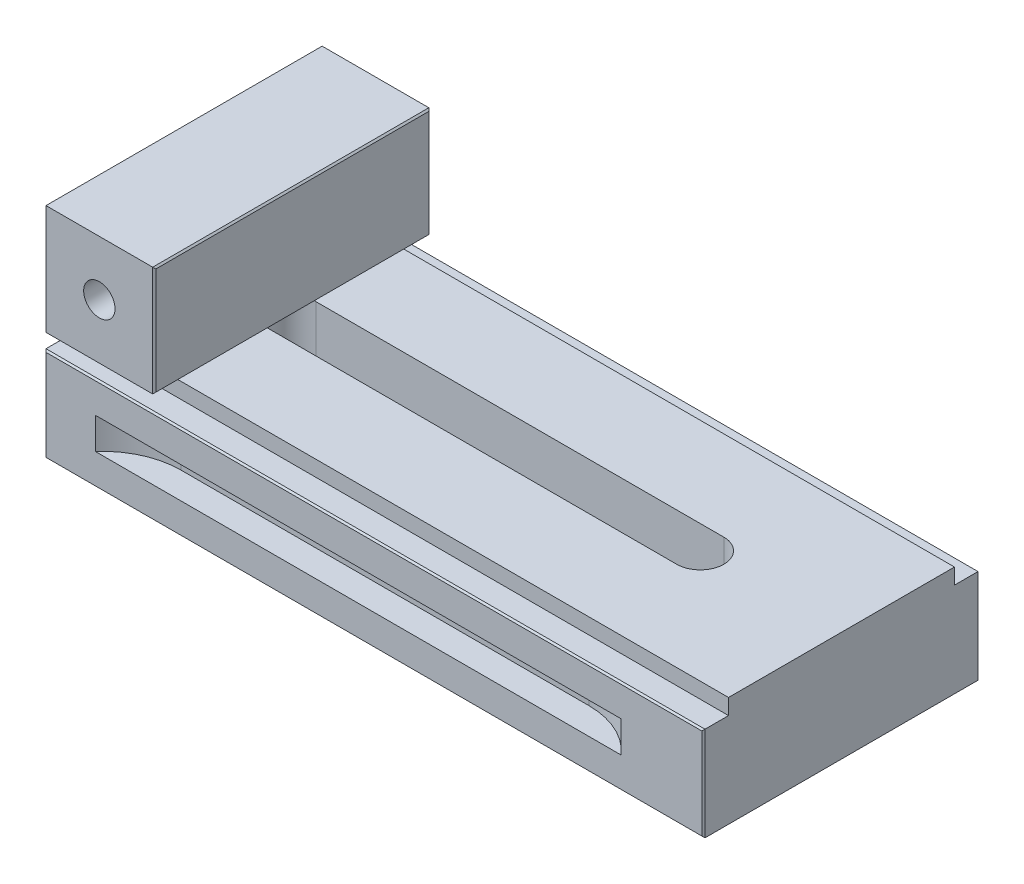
ISO-10303-21;
HEADER;
FILE_DESCRIPTION(('STEP AP214'),'2;1');
FILE_NAME('part.step','',(''),(''),'','','');
FILE_SCHEMA(('AUTOMOTIVE_DESIGN { 1 0 10303 214 1 1 1 1 }'));
ENDSEC;
DATA;
#1=APPLICATION_CONTEXT('core data for automotive mechanical design processes');
#2=APPLICATION_PROTOCOL_DEFINITION('international standard','automotive_design',2000,#1);
#3=PRODUCT_CONTEXT('',#1,'mechanical');
#4=PRODUCT('Part','Part','',(#3));
#5=PRODUCT_RELATED_PRODUCT_CATEGORY('part','',(#4));
#6=PRODUCT_DEFINITION_FORMATION('','',#4);
#7=PRODUCT_DEFINITION_CONTEXT('part definition',#1,'design');
#8=PRODUCT_DEFINITION('design','',#6,#7);
#9=PRODUCT_DEFINITION_SHAPE('','',#8);
#10=(LENGTH_UNIT() NAMED_UNIT(*) SI_UNIT(.MILLI.,.METRE.));
#11=(NAMED_UNIT(*) PLANE_ANGLE_UNIT() SI_UNIT($,.RADIAN.));
#12=(NAMED_UNIT(*) SI_UNIT($,.STERADIAN.) SOLID_ANGLE_UNIT());
#13=UNCERTAINTY_MEASURE_WITH_UNIT(LENGTH_MEASURE(1.E-05),#10,'distance_accuracy_value','');
#14=(GEOMETRIC_REPRESENTATION_CONTEXT(3) GLOBAL_UNCERTAINTY_ASSIGNED_CONTEXT((#13)) GLOBAL_UNIT_ASSIGNED_CONTEXT((#10,
#11,#12)) REPRESENTATION_CONTEXT('',''));
#15=CARTESIAN_POINT('',(0.,0.,0.));
#16=DIRECTION('',(0.,0.,1.));
#17=DIRECTION('',(1.,0.,0.));
#18=AXIS2_PLACEMENT_3D('',#15,#16,#17);
#19=CARTESIAN_POINT('',(0.,-35.,44.));
#20=DIRECTION('',(0.,1.,0.));
#21=DIRECTION('',(0.,0.,1.));
#22=AXIS2_PLACEMENT_3D('',#19,#20,#21);
#23=PLANE('',#22);
#24=DIRECTION('',(-1.,0.,0.));
#25=VECTOR('',#24,1.);
#26=CARTESIAN_POINT('',(175.,-35.,36.));
#27=LINE('',#26,#25);
#28=CARTESIAN_POINT('',(-0.5,-35.,36.));
#29=VERTEX_POINT('',#28);
#30=CARTESIAN_POINT('',(-34.5,-35.,36.));
#31=VERTEX_POINT('',#30);
#32=EDGE_CURVE('E403',#29,#31,#27,.T.);
#33=ORIENTED_EDGE('',*,*,#32,.F.);
#34=DIRECTION('',(0.,0.,1.));
#35=VECTOR('',#34,1.);
#36=CARTESIAN_POINT('',(-0.499999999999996,-35.,44.));
#37=LINE('',#36,#35);
#38=CARTESIAN_POINT('',(-0.499999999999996,-35.,44.));
#39=VERTEX_POINT('',#38);
#40=EDGE_CURVE('E460',#29,#39,#37,.T.);
#41=ORIENTED_EDGE('',*,*,#40,.T.);
#42=DIRECTION('',(1.,0.,0.));
#43=VECTOR('',#42,1.);
#44=CARTESIAN_POINT('',(0.,-35.,44.));
#45=LINE('',#44,#43);
#46=CARTESIAN_POINT('',(-34.5,-35.,44.));
#47=VERTEX_POINT('',#46);
#48=EDGE_CURVE('E442',#47,#39,#45,.T.);
#49=ORIENTED_EDGE('',*,*,#48,.F.);
#50=DIRECTION('',(0.,0.,-1.));
#51=VECTOR('',#50,1.);
#52=CARTESIAN_POINT('',(-34.5,-35.,44.));
#53=LINE('',#52,#51);
#54=EDGE_CURVE('E467',#47,#31,#53,.T.);
#55=ORIENTED_EDGE('',*,*,#54,.T.);
#56=EDGE_LOOP('',(#33,#41,#49,#55));
#57=FACE_BOUND('',#56,.T.);
#58=ADVANCED_FACE('F28',(#57),#23,.F.);
#59=CARTESIAN_POINT('',(0.,0.,44.));
#60=DIRECTION('',(-1.,0.,0.));
#61=DIRECTION('',(0.,-1.,0.));
#62=AXIS2_PLACEMENT_3D('',#59,#60,#61);
#63=PLANE('',#62);
#64=DIRECTION('',(0.,0.,-1.));
#65=VECTOR('',#64,1.);
#66=CARTESIAN_POINT('',(0.,-34.5,44.));
#67=LINE('',#66,#65);
#68=CARTESIAN_POINT('',(0.,-34.5,43.5));
#69=VERTEX_POINT('',#68);
#70=CARTESIAN_POINT('',(0.,-34.5,-43.5));
#71=VERTEX_POINT('',#70);
#72=EDGE_CURVE('E483',#69,#71,#67,.T.);
#73=ORIENTED_EDGE('',*,*,#72,.T.);
#74=DIRECTION('',(0.,1.,0.));
#75=VECTOR('',#74,1.);
#76=CARTESIAN_POINT('',(0.,0.,-43.5));
#77=LINE('',#76,#75);
#78=CARTESIAN_POINT('',(0.,-0.500000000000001,-43.5));
#79=VERTEX_POINT('',#78);
#80=EDGE_CURVE('E485',#71,#79,#77,.T.);
#81=ORIENTED_EDGE('',*,*,#80,.T.);
#82=DIRECTION('',(0.,0.,1.));
#83=VECTOR('',#82,1.);
#84=CARTESIAN_POINT('',(0.,-0.500000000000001,44.));
#85=LINE('',#84,#83);
#86=CARTESIAN_POINT('',(0.,-0.500000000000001,43.5));
#87=VERTEX_POINT('',#86);
#88=EDGE_CURVE('E479',#79,#87,#85,.T.);
#89=ORIENTED_EDGE('',*,*,#88,.T.);
#90=DIRECTION('',(0.,-1.,0.));
#91=VECTOR('',#90,1.);
#92=CARTESIAN_POINT('',(0.,0.,43.5));
#93=LINE('',#92,#91);
#94=EDGE_CURVE('E481',#87,#69,#93,.T.);
#95=ORIENTED_EDGE('',*,*,#94,.T.);
#96=EDGE_LOOP('',(#73,#81,#89,#95));
#97=FACE_BOUND('',#96,.T.);
#98=ADVANCED_FACE('F30',(#97),#63,.F.);
#99=CARTESIAN_POINT('',(0.,0.,44.));
#100=DIRECTION('',(0.,-1.,0.));
#101=DIRECTION('',(1.,0.,0.));
#102=AXIS2_PLACEMENT_3D('',#99,#100,#101);
#103=PLANE('',#102);
#104=DIRECTION('',(-1.,0.,0.));
#105=VECTOR('',#104,1.);
#106=CARTESIAN_POINT('',(0.,0.,-44.));
#107=LINE('',#106,#105);
#108=CARTESIAN_POINT('',(-0.5,0.,-44.));
#109=VERTEX_POINT('',#108);
#110=CARTESIAN_POINT('',(-34.5,0.,-44.));
#111=VERTEX_POINT('',#110);
#112=EDGE_CURVE('E433',#109,#111,#107,.T.);
#113=ORIENTED_EDGE('',*,*,#112,.T.);
#114=DIRECTION('',(0.,0.,1.));
#115=VECTOR('',#114,1.);
#116=CARTESIAN_POINT('',(-34.5,0.,44.));
#117=LINE('',#116,#115);
#118=CARTESIAN_POINT('',(-34.5,0.,44.));
#119=VERTEX_POINT('',#118);
#120=EDGE_CURVE('E477',#111,#119,#117,.T.);
#121=ORIENTED_EDGE('',*,*,#120,.T.);
#122=DIRECTION('',(-1.,0.,0.));
#123=VECTOR('',#122,1.);
#124=CARTESIAN_POINT('',(0.,0.,44.));
#125=LINE('',#124,#123);
#126=CARTESIAN_POINT('',(-0.5,0.,44.));
#127=VERTEX_POINT('',#126);
#128=EDGE_CURVE('E439',#127,#119,#125,.T.);
#129=ORIENTED_EDGE('',*,*,#128,.F.);
#130=DIRECTION('',(0.,0.,-1.));
#131=VECTOR('',#130,1.);
#132=CARTESIAN_POINT('',(-0.5,0.,44.));
#133=LINE('',#132,#131);
#134=EDGE_CURVE('E475',#127,#109,#133,.T.);
#135=ORIENTED_EDGE('',*,*,#134,.T.);
#136=EDGE_LOOP('',(#113,#121,#129,#135));
#137=FACE_BOUND('',#136,.T.);
#138=ADVANCED_FACE('F563',(#137),#103,.F.);
#139=CARTESIAN_POINT('',(-35.,0.,44.));
#140=DIRECTION('',(1.,0.,0.));
#141=DIRECTION('',(0.,1.,0.));
#142=AXIS2_PLACEMENT_3D('',#139,#140,#141);
#143=PLANE('',#142);
#144=DIRECTION('',(0.,0.,-1.));
#145=VECTOR('',#144,1.);
#146=CARTESIAN_POINT('',(-35.,-0.499999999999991,44.));
#147=LINE('',#146,#145);
#148=CARTESIAN_POINT('',(-35.,-0.499999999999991,43.5));
#149=VERTEX_POINT('',#148);
#150=CARTESIAN_POINT('',(-35.,-0.499999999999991,-43.5));
#151=VERTEX_POINT('',#150);
#152=EDGE_CURVE('E445',#149,#151,#147,.T.);
#153=ORIENTED_EDGE('',*,*,#152,.T.);
#154=DIRECTION('',(0.,-1.,0.));
#155=VECTOR('',#154,1.);
#156=CARTESIAN_POINT('',(-35.,-35.,-43.5));
#157=LINE('',#156,#155);
#158=CARTESIAN_POINT('',(-35.,-34.5,-43.5));
#159=VERTEX_POINT('',#158);
#160=EDGE_CURVE('E451',#151,#159,#157,.T.);
#161=ORIENTED_EDGE('',*,*,#160,.T.);
#162=DIRECTION('',(0.,0.,1.));
#163=VECTOR('',#162,1.);
#164=CARTESIAN_POINT('',(-35.,-34.5,44.));
#165=LINE('',#164,#163);
#166=CARTESIAN_POINT('',(-35.,-34.5,43.5));
#167=VERTEX_POINT('',#166);
#168=EDGE_CURVE('E449',#159,#167,#165,.T.);
#169=ORIENTED_EDGE('',*,*,#168,.T.);
#170=DIRECTION('',(0.,1.,0.));
#171=VECTOR('',#170,1.);
#172=CARTESIAN_POINT('',(-35.,0.,43.5));
#173=LINE('',#172,#171);
#174=EDGE_CURVE('E447',#167,#149,#173,.T.);
#175=ORIENTED_EDGE('',*,*,#174,.T.);
#176=EDGE_LOOP('',(#153,#161,#169,#175));
#177=FACE_BOUND('',#176,.T.);
#178=ADVANCED_FACE('F569',(#177),#143,.F.);
#179=CARTESIAN_POINT('',(-0.499999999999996,-35.,-44.));
#180=VERTEX_POINT('',#179);
#181=CARTESIAN_POINT('',(-0.5,-35.,-36.));
#182=VERTEX_POINT('',#181);
#183=EDGE_CURVE('E461',#180,#182,#37,.T.);
#184=ORIENTED_EDGE('',*,*,#183,.T.);
#185=DIRECTION('',(-1.,0.,0.));
#186=VECTOR('',#185,1.);
#187=CARTESIAN_POINT('',(175.,-35.,-36.));
#188=LINE('',#187,#186);
#189=CARTESIAN_POINT('',(-34.5,-35.,-36.));
#190=VERTEX_POINT('',#189);
#191=EDGE_CURVE('E398',#182,#190,#188,.T.);
#192=ORIENTED_EDGE('',*,*,#191,.T.);
#193=CARTESIAN_POINT('',(-34.5,-35.,-44.));
#194=VERTEX_POINT('',#193);
#195=EDGE_CURVE('E464',#190,#194,#53,.T.);
#196=ORIENTED_EDGE('',*,*,#195,.T.);
#197=DIRECTION('',(1.,0.,0.));
#198=VECTOR('',#197,1.);
#199=CARTESIAN_POINT('',(0.,-35.,-44.));
#200=LINE('',#199,#198);
#201=EDGE_CURVE('E436',#194,#180,#200,.T.);
#202=ORIENTED_EDGE('',*,*,#201,.T.);
#203=EDGE_LOOP('',(#184,#192,#196,#202));
#204=FACE_BOUND('',#203,.T.);
#205=ADVANCED_FACE('F557',(#204),#23,.F.);
#206=CARTESIAN_POINT('',(0.,0.,44.));
#207=DIRECTION('',(0.,0.,-1.));
#208=DIRECTION('',(-1.,0.,0.));
#209=AXIS2_PLACEMENT_3D('',#206,#207,#208);
#210=PLANE('',#209);
#211=CARTESIAN_POINT('',(-17.5,-17.5,44.));
#212=DIRECTION('',(0.,0.,1.));
#213=DIRECTION('',(1.,0.,0.));
#214=AXIS2_PLACEMENT_3D('',#211,#212,#213);
#215=CIRCLE('',#214,5.);
#216=CARTESIAN_POINT('',(-12.5,-17.5,44.));
#217=VERTEX_POINT('',#216);
#218=EDGE_CURVE('E396',#217,#217,#215,.T.);
#219=ORIENTED_EDGE('',*,*,#218,.F.);
#220=EDGE_LOOP('',(#219));
#221=FACE_BOUND('',#220,.T.);
#222=ORIENTED_EDGE('',*,*,#128,.T.);
#223=DIRECTION('',(0.,-1.,0.));
#224=VECTOR('',#223,1.);
#225=CARTESIAN_POINT('',(-34.5,0.,44.));
#226=LINE('',#225,#224);
#227=EDGE_CURVE('E473',#119,#47,#226,.T.);
#228=ORIENTED_EDGE('',*,*,#227,.T.);
#229=ORIENTED_EDGE('',*,*,#48,.T.);
#230=DIRECTION('',(0.,1.,0.));
#231=VECTOR('',#230,1.);
#232=CARTESIAN_POINT('',(-0.5,0.,44.));
#233=LINE('',#232,#231);
#234=EDGE_CURVE('E470',#39,#127,#233,.T.);
#235=ORIENTED_EDGE('',*,*,#234,.T.);
#236=EDGE_LOOP('',(#222,#228,#229,#235));
#237=FACE_BOUND('',#236,.T.);
#238=ADVANCED_FACE('F568',(#221,#237),#210,.F.);
#239=CARTESIAN_POINT('',(0.,0.,-44.));
#240=DIRECTION('',(0.,0.,-1.));
#241=DIRECTION('',(-1.,0.,0.));
#242=AXIS2_PLACEMENT_3D('',#239,#240,#241);
#243=PLANE('',#242);
#244=CARTESIAN_POINT('',(-17.5,-17.5,-44.));
#245=DIRECTION('',(0.,0.,1.));
#246=DIRECTION('',(1.,0.,0.));
#247=AXIS2_PLACEMENT_3D('',#244,#245,#246);
#248=CIRCLE('',#247,5.);
#249=CARTESIAN_POINT('',(-12.5,-17.5,-44.));
#250=VERTEX_POINT('',#249);
#251=EDGE_CURVE('E410',#250,#250,#248,.T.);
#252=ORIENTED_EDGE('',*,*,#251,.T.);
#253=EDGE_LOOP('',(#252));
#254=FACE_BOUND('',#253,.T.);
#255=ORIENTED_EDGE('',*,*,#201,.F.);
#256=DIRECTION('',(0.,1.,0.));
#257=VECTOR('',#256,1.);
#258=CARTESIAN_POINT('',(-34.5,0.,-44.));
#259=LINE('',#258,#257);
#260=EDGE_CURVE('E457',#194,#111,#259,.T.);
#261=ORIENTED_EDGE('',*,*,#260,.T.);
#262=ORIENTED_EDGE('',*,*,#112,.F.);
#263=DIRECTION('',(0.,-1.,0.));
#264=VECTOR('',#263,1.);
#265=CARTESIAN_POINT('',(-0.499999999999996,-35.,-44.));
#266=LINE('',#265,#264);
#267=EDGE_CURVE('E454',#109,#180,#266,.T.);
#268=ORIENTED_EDGE('',*,*,#267,.T.);
#269=EDGE_LOOP('',(#255,#261,#262,#268));
#270=FACE_BOUND('',#269,.T.);
#271=ADVANCED_FACE('F575',(#254,#270),#243,.T.);
#272=CARTESIAN_POINT('',(-34.5,0.,44.));
#273=DIRECTION('',(0.707106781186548,0.,-0.707106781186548));
#274=DIRECTION('',(-0.707106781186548,0.,-0.707106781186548));
#275=AXIS2_PLACEMENT_3D('',#272,#273,#274);
#276=PLANE('',#275);
#277=DIRECTION('',(0.577350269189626,-0.577350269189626,0.577350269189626));
#278=VECTOR('',#277,1.);
#279=CARTESIAN_POINT('',(-46.1666666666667,-23.3333333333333,32.3333333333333));
#280=LINE('',#279,#278);
#281=EDGE_CURVE('E427',#47,#167,#280,.F.);
#282=ORIENTED_EDGE('',*,*,#281,.F.);
#283=ORIENTED_EDGE('',*,*,#227,.F.);
#284=DIRECTION('',(0.577350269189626,0.577350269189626,0.577350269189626));
#285=VECTOR('',#284,1.);
#286=CARTESIAN_POINT('',(-34.8333333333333,-0.333333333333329,43.6666666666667));
#287=LINE('',#286,#285);
#288=EDGE_CURVE('E430',#149,#119,#287,.T.);
#289=ORIENTED_EDGE('',*,*,#288,.F.);
#290=ORIENTED_EDGE('',*,*,#174,.F.);
#291=EDGE_LOOP('',(#282,#283,#289,#290));
#292=FACE_BOUND('',#291,.T.);
#293=ADVANCED_FACE('F633',(#292),#276,.F.);
#294=CARTESIAN_POINT('',(-35.,-0.499999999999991,44.));
#295=DIRECTION('',(0.707106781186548,-0.707106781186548,0.));
#296=DIRECTION('',(0.707106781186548,0.707106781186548,0.));
#297=AXIS2_PLACEMENT_3D('',#294,#295,#296);
#298=PLANE('',#297);
#299=ORIENTED_EDGE('',*,*,#288,.T.);
#300=ORIENTED_EDGE('',*,*,#120,.F.);
#301=DIRECTION('',(0.577350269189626,0.577350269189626,-0.577350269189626));
#302=VECTOR('',#301,1.);
#303=CARTESIAN_POINT('',(-64.1666666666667,-29.6666666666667,-14.3333333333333));
#304=LINE('',#303,#302);
#305=EDGE_CURVE('E425',#151,#111,#304,.T.);
#306=ORIENTED_EDGE('',*,*,#305,.F.);
#307=ORIENTED_EDGE('',*,*,#152,.F.);
#308=EDGE_LOOP('',(#299,#300,#306,#307));
#309=FACE_BOUND('',#308,.T.);
#310=ADVANCED_FACE('F618',(#309),#298,.F.);
#311=CARTESIAN_POINT('',(-34.5,-35.,44.));
#312=DIRECTION('',(0.707106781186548,0.707106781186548,0.));
#313=DIRECTION('',(-0.707106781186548,0.707106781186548,0.));
#314=AXIS2_PLACEMENT_3D('',#311,#312,#313);
#315=PLANE('',#314);
#316=ORIENTED_EDGE('',*,*,#281,.T.);
#317=ORIENTED_EDGE('',*,*,#168,.F.);
#318=DIRECTION('',(-0.577350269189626,0.577350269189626,0.577350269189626));
#319=VECTOR('',#318,1.);
#320=CARTESIAN_POINT('',(-63.8333333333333,-5.66666666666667,-14.6666666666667));
#321=LINE('',#320,#319);
#322=EDGE_CURVE('E423',#194,#159,#321,.T.);
#323=ORIENTED_EDGE('',*,*,#322,.F.);
#324=ORIENTED_EDGE('',*,*,#195,.F.);
#325=EDGE_CURVE('E471',#31,#190,#53,.T.);
#326=ORIENTED_EDGE('',*,*,#325,.F.);
#327=ORIENTED_EDGE('',*,*,#54,.F.);
#328=EDGE_LOOP('',(#316,#317,#323,#324,#326,#327));
#329=FACE_BOUND('',#328,.T.);
#330=ADVANCED_FACE('F627',(#329),#315,.F.);
#331=CARTESIAN_POINT('',(-35.,0.,-43.5));
#332=DIRECTION('',(-0.707106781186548,0.,-0.707106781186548));
#333=DIRECTION('',(-0.707106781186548,0.,0.707106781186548));
#334=AXIS2_PLACEMENT_3D('',#331,#332,#333);
#335=PLANE('',#334);
#336=ORIENTED_EDGE('',*,*,#305,.T.);
#337=ORIENTED_EDGE('',*,*,#260,.F.);
#338=ORIENTED_EDGE('',*,*,#322,.T.);
#339=ORIENTED_EDGE('',*,*,#160,.F.);
#340=EDGE_LOOP('',(#336,#337,#338,#339));
#341=FACE_BOUND('',#340,.T.);
#342=ADVANCED_FACE('F624',(#341),#335,.T.);
#343=CARTESIAN_POINT('',(-0.5,0.,44.));
#344=DIRECTION('',(-0.707106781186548,0.,-0.707106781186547));
#345=DIRECTION('',(-0.707106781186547,0.,0.707106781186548));
#346=AXIS2_PLACEMENT_3D('',#343,#344,#345);
#347=PLANE('',#346);
#348=DIRECTION('',(0.577350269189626,-0.577350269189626,-0.577350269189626));
#349=VECTOR('',#348,1.);
#350=CARTESIAN_POINT('',(-0.5,0.,44.));
#351=LINE('',#350,#349);
#352=EDGE_CURVE('E417',#127,#87,#351,.T.);
#353=ORIENTED_EDGE('',*,*,#352,.F.);
#354=ORIENTED_EDGE('',*,*,#234,.F.);
#355=DIRECTION('',(0.577350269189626,0.577350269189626,-0.577350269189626));
#356=VECTOR('',#355,1.);
#357=CARTESIAN_POINT('',(11.1666666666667,-23.3333333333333,32.3333333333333));
#358=LINE('',#357,#356);
#359=EDGE_CURVE('E420',#69,#39,#358,.F.);
#360=ORIENTED_EDGE('',*,*,#359,.F.);
#361=ORIENTED_EDGE('',*,*,#94,.F.);
#362=EDGE_LOOP('',(#353,#354,#360,#361));
#363=FACE_BOUND('',#362,.T.);
#364=ADVANCED_FACE('F609',(#363),#347,.F.);
#365=CARTESIAN_POINT('',(0.,-34.5,44.));
#366=DIRECTION('',(-0.707106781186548,0.707106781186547,0.));
#367=DIRECTION('',(-0.707106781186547,-0.707106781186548,0.));
#368=AXIS2_PLACEMENT_3D('',#365,#366,#367);
#369=PLANE('',#368);
#370=ORIENTED_EDGE('',*,*,#359,.T.);
#371=ORIENTED_EDGE('',*,*,#40,.F.);
#372=CARTESIAN_POINT('',(-0.499999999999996,-35.,7.48331477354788));
#373=VERTEX_POINT('',#372);
#374=EDGE_CURVE('E466',#373,#29,#37,.T.);
#375=ORIENTED_EDGE('',*,*,#374,.F.);
#376=CARTESIAN_POINT('',(-0.499999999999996,-35.,-7.48331477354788));
#377=VERTEX_POINT('',#376);
#378=EDGE_CURVE('E635',#377,#373,#37,.T.);
#379=ORIENTED_EDGE('',*,*,#378,.F.);
#380=EDGE_CURVE('E465',#182,#377,#37,.T.);
#381=ORIENTED_EDGE('',*,*,#380,.F.);
#382=ORIENTED_EDGE('',*,*,#183,.F.);
#383=DIRECTION('',(-0.577350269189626,-0.577350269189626,-0.577350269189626));
#384=VECTOR('',#383,1.);
#385=CARTESIAN_POINT('',(29.1666666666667,-5.33333333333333,-14.3333333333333));
#386=LINE('',#385,#384);
#387=EDGE_CURVE('E415',#71,#180,#386,.T.);
#388=ORIENTED_EDGE('',*,*,#387,.F.);
#389=ORIENTED_EDGE('',*,*,#72,.F.);
#390=EDGE_LOOP('',(#370,#371,#375,#379,#381,#382,#388,#389));
#391=FACE_BOUND('',#390,.T.);
#392=ADVANCED_FACE('F586',(#391),#369,.F.);
#393=CARTESIAN_POINT('',(-0.5,0.,44.));
#394=DIRECTION('',(-0.707106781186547,-0.707106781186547,0.));
#395=DIRECTION('',(0.707106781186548,-0.707106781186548,0.));
#396=AXIS2_PLACEMENT_3D('',#393,#394,#395);
#397=PLANE('',#396);
#398=ORIENTED_EDGE('',*,*,#352,.T.);
#399=ORIENTED_EDGE('',*,*,#88,.F.);
#400=DIRECTION('',(0.577350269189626,-0.577350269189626,0.577350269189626));
#401=VECTOR('',#400,1.);
#402=CARTESIAN_POINT('',(28.8333333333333,-29.3333333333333,-14.6666666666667));
#403=LINE('',#402,#401);
#404=EDGE_CURVE('E413',#109,#79,#403,.T.);
#405=ORIENTED_EDGE('',*,*,#404,.F.);
#406=ORIENTED_EDGE('',*,*,#134,.F.);
#407=EDGE_LOOP('',(#398,#399,#405,#406));
#408=FACE_BOUND('',#407,.T.);
#409=ADVANCED_FACE('F601',(#408),#397,.F.);
#410=CARTESIAN_POINT('',(0.,0.,-43.5));
#411=DIRECTION('',(0.707106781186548,0.,-0.707106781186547));
#412=DIRECTION('',(-0.707106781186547,0.,-0.707106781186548));
#413=AXIS2_PLACEMENT_3D('',#410,#411,#412);
#414=PLANE('',#413);
#415=ORIENTED_EDGE('',*,*,#387,.T.);
#416=ORIENTED_EDGE('',*,*,#267,.F.);
#417=ORIENTED_EDGE('',*,*,#404,.T.);
#418=ORIENTED_EDGE('',*,*,#80,.F.);
#419=EDGE_LOOP('',(#415,#416,#417,#418));
#420=FACE_BOUND('',#419,.T.);
#421=ADVANCED_FACE('F597',(#420),#414,.T.);
#422=CARTESIAN_POINT('',(-17.5,-17.5,-44.));
#423=DIRECTION('',(0.,0.,1.));
#424=DIRECTION('',(1.,0.,0.));
#425=AXIS2_PLACEMENT_3D('',#422,#423,#424);
#426=CYLINDRICAL_SURFACE('',#425,5.);
#427=ORIENTED_EDGE('',*,*,#251,.F.);
#428=EDGE_LOOP('',(#427));
#429=FACE_BOUND('',#428,.T.);
#430=ORIENTED_EDGE('',*,*,#218,.T.);
#431=EDGE_LOOP('',(#430));
#432=FACE_BOUND('',#431,.T.);
#433=ADVANCED_FACE('F728',(#429,#432),#426,.F.);
#434=CARTESIAN_POINT('',(175.,-35.,-36.));
#435=DIRECTION('',(0.,1.,0.));
#436=DIRECTION('',(-1.,0.,0.));
#437=AXIS2_PLACEMENT_3D('',#434,#435,#436);
#438=PLANE('',#437);
#439=CARTESIAN_POINT('',(-35.,-35.,36.));
#440=VERTEX_POINT('',#439);
#441=EDGE_CURVE('E402',#31,#440,#27,.T.);
#442=ORIENTED_EDGE('',*,*,#441,.F.);
#443=ORIENTED_EDGE('',*,*,#325,.T.);
#444=CARTESIAN_POINT('',(-35.,-35.,-36.));
#445=VERTEX_POINT('',#444);
#446=EDGE_CURVE('E397',#190,#445,#188,.T.);
#447=ORIENTED_EDGE('',*,*,#446,.T.);
#448=DIRECTION('',(0.,0.,-1.));
#449=VECTOR('',#448,1.);
#450=CARTESIAN_POINT('',(-35.,-35.,-36.));
#451=LINE('',#450,#449);
#452=EDGE_CURVE('E372',#440,#445,#451,.T.);
#453=ORIENTED_EDGE('',*,*,#452,.F.);
#454=EDGE_LOOP('',(#442,#443,#447,#453));
#455=FACE_BOUND('',#454,.T.);
#456=ADVANCED_FACE('F725',(#455),#438,.T.);
#457=CARTESIAN_POINT('',(175.,-40.,-36.));
#458=DIRECTION('',(0.,0.,-1.));
#459=DIRECTION('',(0.,1.,0.));
#460=AXIS2_PLACEMENT_3D('',#457,#458,#459);
#461=PLANE('',#460);
#462=DIRECTION('',(0.,-1.,0.));
#463=VECTOR('',#462,1.);
#464=CARTESIAN_POINT('',(-35.,-40.,-36.));
#465=LINE('',#464,#463);
#466=CARTESIAN_POINT('',(-35.,-40.,-36.));
#467=VERTEX_POINT('',#466);
#468=EDGE_CURVE('E353',#445,#467,#465,.T.);
#469=ORIENTED_EDGE('',*,*,#468,.F.);
#470=ORIENTED_EDGE('',*,*,#446,.F.);
#471=ORIENTED_EDGE('',*,*,#191,.F.);
#472=CARTESIAN_POINT('',(175.,-35.,-36.));
#473=VERTEX_POINT('',#472);
#474=EDGE_CURVE('E393',#473,#182,#188,.T.);
#475=ORIENTED_EDGE('',*,*,#474,.F.);
#476=DIRECTION('',(0.,-1.,0.));
#477=VECTOR('',#476,1.);
#478=CARTESIAN_POINT('',(175.,-40.,-36.));
#479=LINE('',#478,#477);
#480=CARTESIAN_POINT('',(175.,-40.,-36.));
#481=VERTEX_POINT('',#480);
#482=EDGE_CURVE('E375',#473,#481,#479,.T.);
#483=ORIENTED_EDGE('',*,*,#482,.T.);
#484=DIRECTION('',(-1.,0.,0.));
#485=VECTOR('',#484,1.);
#486=CARTESIAN_POINT('',(175.,-40.,-36.));
#487=LINE('',#486,#485);
#488=EDGE_CURVE('E392',#481,#467,#487,.T.);
#489=ORIENTED_EDGE('',*,*,#488,.T.);
#490=EDGE_LOOP('',(#469,#470,#471,#475,#483,#489));
#491=FACE_BOUND('',#490,.T.);
#492=ADVANCED_FACE('F664',(#491),#461,.T.);
#493=CARTESIAN_POINT('',(0.,-35.,0.));
#494=DIRECTION('',(0.,1.,0.));
#495=DIRECTION('',(-1.,0.,0.));
#496=AXIS2_PLACEMENT_3D('',#493,#494,#495);
#497=CIRCLE('',#496,7.5);
#498=CARTESIAN_POINT('',(0.,-35.,-7.5));
#499=VERTEX_POINT('',#498);
#500=EDGE_CURVE('E325',#499,#377,#497,.T.);
#501=ORIENTED_EDGE('',*,*,#500,.F.);
#502=DIRECTION('',(-1.,0.,0.));
#503=VECTOR('',#502,1.);
#504=CARTESIAN_POINT('',(0.,-35.,-7.5));
#505=LINE('',#504,#503);
#506=CARTESIAN_POINT('',(130.,-35.,-7.50000000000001));
#507=VERTEX_POINT('',#506);
#508=EDGE_CURVE('E335',#507,#499,#505,.T.);
#509=ORIENTED_EDGE('',*,*,#508,.F.);
#510=CARTESIAN_POINT('',(130.,-35.,0.));
#511=DIRECTION('',(0.,1.,0.));
#512=DIRECTION('',(1.,0.,0.));
#513=AXIS2_PLACEMENT_3D('',#510,#511,#512);
#514=CIRCLE('',#513,7.50000000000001);
#515=CARTESIAN_POINT('',(130.,-35.,7.49999999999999));
#516=VERTEX_POINT('',#515);
#517=EDGE_CURVE('E332',#516,#507,#514,.T.);
#518=ORIENTED_EDGE('',*,*,#517,.F.);
#519=DIRECTION('',(1.,0.,0.));
#520=VECTOR('',#519,1.);
#521=CARTESIAN_POINT('',(130.,-35.,7.5));
#522=LINE('',#521,#520);
#523=CARTESIAN_POINT('',(0.,-35.,7.5));
#524=VERTEX_POINT('',#523);
#525=EDGE_CURVE('E328',#524,#516,#522,.T.);
#526=ORIENTED_EDGE('',*,*,#525,.F.);
#527=EDGE_CURVE('E324',#373,#524,#497,.T.);
#528=ORIENTED_EDGE('',*,*,#527,.F.);
#529=ORIENTED_EDGE('',*,*,#374,.T.);
#530=CARTESIAN_POINT('',(175.,-35.,36.));
#531=VERTEX_POINT('',#530);
#532=EDGE_CURVE('E399',#531,#29,#27,.T.);
#533=ORIENTED_EDGE('',*,*,#532,.F.);
#534=DIRECTION('',(0.,0.,-1.));
#535=VECTOR('',#534,1.);
#536=CARTESIAN_POINT('',(175.,-35.,-36.));
#537=LINE('',#536,#535);
#538=EDGE_CURVE('E389',#531,#473,#537,.T.);
#539=ORIENTED_EDGE('',*,*,#538,.T.);
#540=ORIENTED_EDGE('',*,*,#474,.T.);
#541=ORIENTED_EDGE('',*,*,#380,.T.);
#542=EDGE_LOOP('',(#501,#509,#518,#526,#528,#529,#533,#539,#540,#541));
#543=FACE_BOUND('',#542,.T.);
#544=ADVANCED_FACE('F646',(#543),#438,.T.);
#545=CARTESIAN_POINT('',(175.,-35.,36.));
#546=DIRECTION('',(0.,0.,1.));
#547=DIRECTION('',(0.,-1.,0.));
#548=AXIS2_PLACEMENT_3D('',#545,#546,#547);
#549=PLANE('',#548);
#550=DIRECTION('',(0.,1.,0.));
#551=VECTOR('',#550,1.);
#552=CARTESIAN_POINT('',(-35.,-35.,36.));
#553=LINE('',#552,#551);
#554=CARTESIAN_POINT('',(-35.,-40.,36.));
#555=VERTEX_POINT('',#554);
#556=EDGE_CURVE('E369',#555,#440,#553,.T.);
#557=ORIENTED_EDGE('',*,*,#556,.F.);
#558=DIRECTION('',(-1.,0.,0.));
#559=VECTOR('',#558,1.);
#560=CARTESIAN_POINT('',(175.,-40.,36.));
#561=LINE('',#560,#559);
#562=CARTESIAN_POINT('',(175.,-40.,36.));
#563=VERTEX_POINT('',#562);
#564=EDGE_CURVE('E404',#563,#555,#561,.T.);
#565=ORIENTED_EDGE('',*,*,#564,.F.);
#566=DIRECTION('',(0.,1.,0.));
#567=VECTOR('',#566,1.);
#568=CARTESIAN_POINT('',(175.,-35.,36.));
#569=LINE('',#568,#567);
#570=EDGE_CURVE('E386',#563,#531,#569,.T.);
#571=ORIENTED_EDGE('',*,*,#570,.T.);
#572=ORIENTED_EDGE('',*,*,#532,.T.);
#573=ORIENTED_EDGE('',*,*,#32,.T.);
#574=ORIENTED_EDGE('',*,*,#441,.T.);
#575=EDGE_LOOP('',(#557,#565,#571,#572,#573,#574));
#576=FACE_BOUND('',#575,.T.);
#577=ADVANCED_FACE('F722',(#576),#549,.T.);
#578=CARTESIAN_POINT('',(175.,-40.,36.));
#579=DIRECTION('',(0.,1.,0.));
#580=DIRECTION('',(-1.,0.,0.));
#581=AXIS2_PLACEMENT_3D('',#578,#579,#580);
#582=PLANE('',#581);
#583=DIRECTION('',(0.,0.,-1.));
#584=VECTOR('',#583,1.);
#585=CARTESIAN_POINT('',(-35.,-40.,36.));
#586=LINE('',#585,#584);
#587=CARTESIAN_POINT('',(-35.,-40.,43.5));
#588=VERTEX_POINT('',#587);
#589=EDGE_CURVE('E367',#588,#555,#586,.T.);
#590=ORIENTED_EDGE('',*,*,#589,.F.);
#591=DIRECTION('',(1.,0.,0.));
#592=VECTOR('',#591,1.);
#593=CARTESIAN_POINT('',(175.,-40.,43.5));
#594=LINE('',#593,#592);
#595=CARTESIAN_POINT('',(175.,-40.,43.5));
#596=VERTEX_POINT('',#595);
#597=EDGE_CURVE('E522',#588,#596,#594,.T.);
#598=ORIENTED_EDGE('',*,*,#597,.T.);
#599=DIRECTION('',(0.,0.,-1.));
#600=VECTOR('',#599,1.);
#601=CARTESIAN_POINT('',(175.,-40.,36.));
#602=LINE('',#601,#600);
#603=EDGE_CURVE('E384',#596,#563,#602,.T.);
#604=ORIENTED_EDGE('',*,*,#603,.T.);
#605=ORIENTED_EDGE('',*,*,#564,.T.);
#606=EDGE_LOOP('',(#590,#598,#604,#605));
#607=FACE_BOUND('',#606,.T.);
#608=ADVANCED_FACE('F718',(#607),#582,.T.);
#609=CARTESIAN_POINT('',(175.,-40.,44.));
#610=DIRECTION('',(0.,0.,1.));
#611=DIRECTION('',(0.,-1.,0.));
#612=AXIS2_PLACEMENT_3D('',#609,#610,#611);
#613=PLANE('',#612);
#614=DIRECTION('',(-1.,0.,0.));
#615=VECTOR('',#614,1.);
#616=CARTESIAN_POINT('',(175.,-50.,44.));
#617=LINE('',#616,#615);
#618=CARTESIAN_POINT('',(148.781639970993,-50.,44.));
#619=VERTEX_POINT('',#618);
#620=CARTESIAN_POINT('',(-18.7816399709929,-50.,44.));
#621=VERTEX_POINT('',#620);
#622=EDGE_CURVE('E531',#619,#621,#617,.T.);
#623=ORIENTED_EDGE('',*,*,#622,.F.);
#624=DIRECTION('',(0.,-1.,0.));
#625=VECTOR('',#624,1.);
#626=CARTESIAN_POINT('',(148.781639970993,-50.,44.));
#627=LINE('',#626,#625);
#628=CARTESIAN_POINT('',(148.781639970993,-60.,44.));
#629=VERTEX_POINT('',#628);
#630=EDGE_CURVE('E527',#629,#619,#627,.F.);
#631=ORIENTED_EDGE('',*,*,#630,.F.);
#632=DIRECTION('',(-1.,0.,0.));
#633=VECTOR('',#632,1.);
#634=CARTESIAN_POINT('',(175.,-60.,44.));
#635=LINE('',#634,#633);
#636=CARTESIAN_POINT('',(-18.7816399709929,-60.,44.));
#637=VERTEX_POINT('',#636);
#638=EDGE_CURVE('E524',#629,#637,#635,.T.);
#639=ORIENTED_EDGE('',*,*,#638,.T.);
#640=DIRECTION('',(0.,-1.,0.));
#641=VECTOR('',#640,1.);
#642=CARTESIAN_POINT('',(-18.7816399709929,-50.,44.));
#643=LINE('',#642,#641);
#644=EDGE_CURVE('E529',#621,#637,#643,.T.);
#645=ORIENTED_EDGE('',*,*,#644,.F.);
#646=EDGE_LOOP('',(#623,#631,#639,#645));
#647=FACE_BOUND('',#646,.T.);
#648=DIRECTION('',(1.,0.,0.));
#649=VECTOR('',#648,1.);
#650=CARTESIAN_POINT('',(175.,-69.5,44.));
#651=LINE('',#650,#649);
#652=CARTESIAN_POINT('',(-34.5,-69.5,44.));
#653=VERTEX_POINT('',#652);
#654=CARTESIAN_POINT('',(174.5,-69.5,44.));
#655=VERTEX_POINT('',#654);
#656=EDGE_CURVE('E517',#653,#655,#651,.T.);
#657=ORIENTED_EDGE('',*,*,#656,.T.);
#658=DIRECTION('',(0.,1.,0.));
#659=VECTOR('',#658,1.);
#660=CARTESIAN_POINT('',(174.5,-40.,44.));
#661=LINE('',#660,#659);
#662=CARTESIAN_POINT('',(174.5,-40.5,44.));
#663=VERTEX_POINT('',#662);
#664=EDGE_CURVE('E519',#655,#663,#661,.T.);
#665=ORIENTED_EDGE('',*,*,#664,.T.);
#666=DIRECTION('',(-1.,0.,0.));
#667=VECTOR('',#666,1.);
#668=CARTESIAN_POINT('',(175.,-40.5,44.));
#669=LINE('',#668,#667);
#670=CARTESIAN_POINT('',(-34.5,-40.5,44.));
#671=VERTEX_POINT('',#670);
#672=EDGE_CURVE('E513',#663,#671,#669,.T.);
#673=ORIENTED_EDGE('',*,*,#672,.T.);
#674=DIRECTION('',(0.,-1.,0.));
#675=VECTOR('',#674,1.);
#676=CARTESIAN_POINT('',(-34.5,-70.,44.));
#677=LINE('',#676,#675);
#678=EDGE_CURVE('E515',#671,#653,#677,.T.);
#679=ORIENTED_EDGE('',*,*,#678,.T.);
#680=EDGE_LOOP('',(#657,#665,#673,#679));
#681=FACE_BOUND('',#680,.T.);
#682=ADVANCED_FACE('F713',(#647,#681),#613,.T.);
#683=CARTESIAN_POINT('',(175.,-70.,44.));
#684=DIRECTION('',(0.,-1.,0.));
#685=DIRECTION('',(1.,0.,0.));
#686=AXIS2_PLACEMENT_3D('',#683,#684,#685);
#687=PLANE('',#686);
#688=CARTESIAN_POINT('',(0.,-70.,0.));
#689=DIRECTION('',(0.,1.,0.));
#690=DIRECTION('',(-1.,0.,0.));
#691=AXIS2_PLACEMENT_3D('',#688,#689,#690);
#692=CIRCLE('',#691,7.5);
#693=CARTESIAN_POINT('',(0.,-70.,-7.5));
#694=VERTEX_POINT('',#693);
#695=CARTESIAN_POINT('',(0.,-70.,7.5));
#696=VERTEX_POINT('',#695);
#697=EDGE_CURVE('E338',#694,#696,#692,.T.);
#698=ORIENTED_EDGE('',*,*,#697,.T.);
#699=DIRECTION('',(1.,0.,0.));
#700=VECTOR('',#699,1.);
#701=CARTESIAN_POINT('',(130.,-70.,7.5));
#702=LINE('',#701,#700);
#703=CARTESIAN_POINT('',(130.,-70.,7.5));
#704=VERTEX_POINT('',#703);
#705=EDGE_CURVE('E341',#696,#704,#702,.T.);
#706=ORIENTED_EDGE('',*,*,#705,.T.);
#707=CARTESIAN_POINT('',(130.,-70.,0.));
#708=DIRECTION('',(0.,1.,0.));
#709=DIRECTION('',(1.,0.,0.));
#710=AXIS2_PLACEMENT_3D('',#707,#708,#709);
#711=CIRCLE('',#710,7.50000000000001);
#712=CARTESIAN_POINT('',(130.,-70.,-7.50000000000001));
#713=VERTEX_POINT('',#712);
#714=EDGE_CURVE('E344',#704,#713,#711,.T.);
#715=ORIENTED_EDGE('',*,*,#714,.T.);
#716=DIRECTION('',(-1.,0.,0.));
#717=VECTOR('',#716,1.);
#718=CARTESIAN_POINT('',(0.,-70.,-7.5));
#719=LINE('',#718,#717);
#720=EDGE_CURVE('E347',#713,#694,#719,.T.);
#721=ORIENTED_EDGE('',*,*,#720,.T.);
#722=EDGE_LOOP('',(#698,#706,#715,#721));
#723=FACE_BOUND('',#722,.T.);
#724=DIRECTION('',(0.,0.,1.));
#725=VECTOR('',#724,1.);
#726=CARTESIAN_POINT('',(-35.,-70.,44.));
#727=LINE('',#726,#725);
#728=CARTESIAN_POINT('',(-35.,-70.,-43.5));
#729=VERTEX_POINT('',#728);
#730=CARTESIAN_POINT('',(-35.,-70.,43.5));
#731=VERTEX_POINT('',#730);
#732=EDGE_CURVE('E364',#729,#731,#727,.T.);
#733=ORIENTED_EDGE('',*,*,#732,.F.);
#734=DIRECTION('',(1.,0.,0.));
#735=VECTOR('',#734,1.);
#736=CARTESIAN_POINT('',(175.,-70.,-43.5));
#737=LINE('',#736,#735);
#738=CARTESIAN_POINT('',(175.,-70.,-43.5));
#739=VERTEX_POINT('',#738);
#740=EDGE_CURVE('E504',#729,#739,#737,.T.);
#741=ORIENTED_EDGE('',*,*,#740,.T.);
#742=DIRECTION('',(0.,0.,1.));
#743=VECTOR('',#742,1.);
#744=CARTESIAN_POINT('',(175.,-70.,44.));
#745=LINE('',#744,#743);
#746=CARTESIAN_POINT('',(175.,-70.,43.5));
#747=VERTEX_POINT('',#746);
#748=EDGE_CURVE('E381',#739,#747,#745,.T.);
#749=ORIENTED_EDGE('',*,*,#748,.T.);
#750=DIRECTION('',(-1.,0.,0.));
#751=VECTOR('',#750,1.);
#752=CARTESIAN_POINT('',(175.,-70.,43.5));
#753=LINE('',#752,#751);
#754=EDGE_CURVE('E502',#747,#731,#753,.T.);
#755=ORIENTED_EDGE('',*,*,#754,.T.);
#756=EDGE_LOOP('',(#733,#741,#749,#755));
#757=FACE_BOUND('',#756,.T.);
#758=ADVANCED_FACE('F656',(#723,#757),#687,.T.);
#759=CARTESIAN_POINT('',(175.,-70.,-44.));
#760=DIRECTION('',(0.,0.,-1.));
#761=DIRECTION('',(-1.,0.,0.));
#762=AXIS2_PLACEMENT_3D('',#759,#760,#761);
#763=PLANE('',#762);
#764=DIRECTION('',(1.,0.,0.));
#765=VECTOR('',#764,1.);
#766=CARTESIAN_POINT('',(175.,-50.,-44.));
#767=LINE('',#766,#765);
#768=CARTESIAN_POINT('',(-18.7816399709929,-50.,-44.));
#769=VERTEX_POINT('',#768);
#770=CARTESIAN_POINT('',(148.781639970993,-50.,-44.));
#771=VERTEX_POINT('',#770);
#772=EDGE_CURVE('E12',#769,#771,#767,.T.);
#773=ORIENTED_EDGE('',*,*,#772,.F.);
#774=DIRECTION('',(0.,-1.,0.));
#775=VECTOR('',#774,1.);
#776=CARTESIAN_POINT('',(-18.7816399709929,-50.,-44.));
#777=LINE('',#776,#775);
#778=CARTESIAN_POINT('',(-18.7816399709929,-60.,-44.));
#779=VERTEX_POINT('',#778);
#780=EDGE_CURVE('E36',#769,#779,#777,.T.);
#781=ORIENTED_EDGE('',*,*,#780,.T.);
#782=DIRECTION('',(1.,0.,0.));
#783=VECTOR('',#782,1.);
#784=CARTESIAN_POINT('',(175.,-60.,-44.));
#785=LINE('',#784,#783);
#786=CARTESIAN_POINT('',(148.781639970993,-60.,-44.));
#787=VERTEX_POINT('',#786);
#788=EDGE_CURVE('E533',#779,#787,#785,.T.);
#789=ORIENTED_EDGE('',*,*,#788,.T.);
#790=DIRECTION('',(0.,-1.,0.));
#791=VECTOR('',#790,1.);
#792=CARTESIAN_POINT('',(148.781639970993,-50.,-44.));
#793=LINE('',#792,#791);
#794=EDGE_CURVE('E274',#787,#771,#793,.F.);
#795=ORIENTED_EDGE('',*,*,#794,.T.);
#796=EDGE_LOOP('',(#773,#781,#789,#795));
#797=FACE_BOUND('',#796,.T.);
#798=DIRECTION('',(-1.,0.,0.));
#799=VECTOR('',#798,1.);
#800=CARTESIAN_POINT('',(175.,-69.5,-44.));
#801=LINE('',#800,#799);
#802=CARTESIAN_POINT('',(174.5,-69.5,-44.));
#803=VERTEX_POINT('',#802);
#804=CARTESIAN_POINT('',(-34.5,-69.5,-44.));
#805=VERTEX_POINT('',#804);
#806=EDGE_CURVE('E497',#803,#805,#801,.T.);
#807=ORIENTED_EDGE('',*,*,#806,.T.);
#808=DIRECTION('',(0.,1.,0.));
#809=VECTOR('',#808,1.);
#810=CARTESIAN_POINT('',(-34.5,-40.,-44.));
#811=LINE('',#810,#809);
#812=CARTESIAN_POINT('',(-34.5,-40.5,-44.));
#813=VERTEX_POINT('',#812);
#814=EDGE_CURVE('E499',#805,#813,#811,.T.);
#815=ORIENTED_EDGE('',*,*,#814,.T.);
#816=DIRECTION('',(1.,0.,0.));
#817=VECTOR('',#816,1.);
#818=CARTESIAN_POINT('',(175.,-40.5,-44.));
#819=LINE('',#818,#817);
#820=CARTESIAN_POINT('',(174.5,-40.5,-44.));
#821=VERTEX_POINT('',#820);
#822=EDGE_CURVE('E493',#813,#821,#819,.T.);
#823=ORIENTED_EDGE('',*,*,#822,.T.);
#824=DIRECTION('',(0.,-1.,0.));
#825=VECTOR('',#824,1.);
#826=CARTESIAN_POINT('',(174.5,-70.,-44.));
#827=LINE('',#826,#825);
#828=EDGE_CURVE('E495',#821,#803,#827,.T.);
#829=ORIENTED_EDGE('',*,*,#828,.T.);
#830=EDGE_LOOP('',(#807,#815,#823,#829));
#831=FACE_BOUND('',#830,.T.);
#832=ADVANCED_FACE('F538',(#797,#831),#763,.T.);
#833=CARTESIAN_POINT('',(175.,-40.,-44.));
#834=DIRECTION('',(0.,1.,0.));
#835=DIRECTION('',(-1.,0.,0.));
#836=AXIS2_PLACEMENT_3D('',#833,#834,#835);
#837=PLANE('',#836);
#838=DIRECTION('',(0.,0.,-1.));
#839=VECTOR('',#838,1.);
#840=CARTESIAN_POINT('',(175.,-40.,-44.));
#841=LINE('',#840,#839);
#842=CARTESIAN_POINT('',(175.,-40.,-43.5));
#843=VERTEX_POINT('',#842);
#844=EDGE_CURVE('E378',#481,#843,#841,.T.);
#845=ORIENTED_EDGE('',*,*,#844,.T.);
#846=DIRECTION('',(-1.,0.,0.));
#847=VECTOR('',#846,1.);
#848=CARTESIAN_POINT('',(175.,-40.,-43.5));
#849=LINE('',#848,#847);
#850=CARTESIAN_POINT('',(-35.,-40.,-43.5));
#851=VERTEX_POINT('',#850);
#852=EDGE_CURVE('E511',#843,#851,#849,.T.);
#853=ORIENTED_EDGE('',*,*,#852,.T.);
#854=DIRECTION('',(0.,0.,-1.));
#855=VECTOR('',#854,1.);
#856=CARTESIAN_POINT('',(-35.,-40.,-44.));
#857=LINE('',#856,#855);
#858=EDGE_CURVE('E361',#467,#851,#857,.T.);
#859=ORIENTED_EDGE('',*,*,#858,.F.);
#860=ORIENTED_EDGE('',*,*,#488,.F.);
#861=EDGE_LOOP('',(#845,#853,#859,#860));
#862=FACE_BOUND('',#861,.T.);
#863=ADVANCED_FACE('F673',(#862),#837,.T.);
#864=CARTESIAN_POINT('',(175.,-35.,-36.));
#865=DIRECTION('',(1.,0.,0.));
#866=DIRECTION('',(0.,0.,-1.));
#867=AXIS2_PLACEMENT_3D('',#864,#865,#866);
#868=PLANE('',#867);
#869=ORIENTED_EDGE('',*,*,#748,.F.);
#870=DIRECTION('',(0.,1.,0.));
#871=VECTOR('',#870,1.);
#872=CARTESIAN_POINT('',(175.,-35.,-43.5));
#873=LINE('',#872,#871);
#874=EDGE_CURVE('E509',#739,#843,#873,.T.);
#875=ORIENTED_EDGE('',*,*,#874,.T.);
#876=ORIENTED_EDGE('',*,*,#844,.F.);
#877=ORIENTED_EDGE('',*,*,#482,.F.);
#878=ORIENTED_EDGE('',*,*,#538,.F.);
#879=ORIENTED_EDGE('',*,*,#570,.F.);
#880=ORIENTED_EDGE('',*,*,#603,.F.);
#881=DIRECTION('',(0.,-1.,0.));
#882=VECTOR('',#881,1.);
#883=CARTESIAN_POINT('',(175.,-34.9999999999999,43.5));
#884=LINE('',#883,#882);
#885=EDGE_CURVE('E506',#596,#747,#884,.T.);
#886=ORIENTED_EDGE('',*,*,#885,.T.);
#887=EDGE_LOOP('',(#869,#875,#876,#877,#878,#879,#880,#886));
#888=FACE_BOUND('',#887,.T.);
#889=ADVANCED_FACE('F668',(#888),#868,.T.);
#890=CARTESIAN_POINT('',(-35.,-35.,-36.));
#891=DIRECTION('',(1.,0.,0.));
#892=DIRECTION('',(0.,0.,-1.));
#893=AXIS2_PLACEMENT_3D('',#890,#891,#892);
#894=PLANE('',#893);
#895=ORIENTED_EDGE('',*,*,#858,.T.);
#896=DIRECTION('',(0.,-1.,0.));
#897=VECTOR('',#896,1.);
#898=CARTESIAN_POINT('',(-35.,-70.,-43.5));
#899=LINE('',#898,#897);
#900=EDGE_CURVE('E490',#851,#729,#899,.T.);
#901=ORIENTED_EDGE('',*,*,#900,.T.);
#902=ORIENTED_EDGE('',*,*,#732,.T.);
#903=DIRECTION('',(0.,1.,0.));
#904=VECTOR('',#903,1.);
#905=CARTESIAN_POINT('',(-35.,-40.,43.5));
#906=LINE('',#905,#904);
#907=EDGE_CURVE('E488',#731,#588,#906,.T.);
#908=ORIENTED_EDGE('',*,*,#907,.T.);
#909=ORIENTED_EDGE('',*,*,#589,.T.);
#910=ORIENTED_EDGE('',*,*,#556,.T.);
#911=ORIENTED_EDGE('',*,*,#452,.T.);
#912=ORIENTED_EDGE('',*,*,#468,.T.);
#913=EDGE_LOOP('',(#895,#901,#902,#908,#909,#910,#911,#912));
#914=FACE_BOUND('',#913,.T.);
#915=ADVANCED_FACE('F692',(#914),#894,.F.);
#916=CARTESIAN_POINT('',(0.,-70.,0.));
#917=DIRECTION('',(0.,1.,0.));
#918=DIRECTION('',(-1.,0.,0.));
#919=AXIS2_PLACEMENT_3D('',#916,#917,#918);
#920=CYLINDRICAL_SURFACE('',#919,7.5);
#921=ORIENTED_EDGE('',*,*,#500,.T.);
#922=EDGE_CURVE('E329',#377,#373,#497,.T.);
#923=ORIENTED_EDGE('',*,*,#922,.T.);
#924=ORIENTED_EDGE('',*,*,#527,.T.);
#925=DIRECTION('',(0.,1.,0.));
#926=VECTOR('',#925,1.);
#927=CARTESIAN_POINT('',(0.,-70.,7.5));
#928=LINE('',#927,#926);
#929=EDGE_CURVE('E350',#696,#524,#928,.T.);
#930=ORIENTED_EDGE('',*,*,#929,.F.);
#931=ORIENTED_EDGE('',*,*,#697,.F.);
#932=DIRECTION('',(0.,1.,0.));
#933=VECTOR('',#932,1.);
#934=CARTESIAN_POINT('',(0.,-70.,-7.5));
#935=LINE('',#934,#933);
#936=EDGE_CURVE('E351',#694,#499,#935,.T.);
#937=ORIENTED_EDGE('',*,*,#936,.T.);
#938=EDGE_LOOP('',(#921,#923,#924,#930,#931,#937));
#939=FACE_BOUND('',#938,.T.);
#940=ADVANCED_FACE('F642',(#939),#920,.F.);
#941=CARTESIAN_POINT('',(0.,-70.,-7.5));
#942=DIRECTION('',(0.,0.,-1.));
#943=DIRECTION('',(-1.,0.,0.));
#944=AXIS2_PLACEMENT_3D('',#941,#942,#943);
#945=PLANE('',#944);
#946=ORIENTED_EDGE('',*,*,#508,.T.);
#947=ORIENTED_EDGE('',*,*,#936,.F.);
#948=ORIENTED_EDGE('',*,*,#720,.F.);
#949=DIRECTION('',(0.,1.,0.));
#950=VECTOR('',#949,1.);
#951=CARTESIAN_POINT('',(130.,-70.,-7.50000000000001));
#952=LINE('',#951,#950);
#953=EDGE_CURVE('E354',#713,#507,#952,.T.);
#954=ORIENTED_EDGE('',*,*,#953,.T.);
#955=EDGE_LOOP('',(#946,#947,#948,#954));
#956=FACE_BOUND('',#955,.T.);
#957=ADVANCED_FACE('F659',(#956),#945,.F.);
#958=CARTESIAN_POINT('',(130.,-70.,0.));
#959=DIRECTION('',(0.,1.,0.));
#960=DIRECTION('',(-1.,0.,0.));
#961=AXIS2_PLACEMENT_3D('',#958,#959,#960);
#962=CYLINDRICAL_SURFACE('',#961,7.50000000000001);
#963=ORIENTED_EDGE('',*,*,#517,.T.);
#964=ORIENTED_EDGE('',*,*,#953,.F.);
#965=ORIENTED_EDGE('',*,*,#714,.F.);
#966=DIRECTION('',(0.,1.,0.));
#967=VECTOR('',#966,1.);
#968=CARTESIAN_POINT('',(130.,-70.,7.49999999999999));
#969=LINE('',#968,#967);
#970=EDGE_CURVE('E356',#704,#516,#969,.T.);
#971=ORIENTED_EDGE('',*,*,#970,.T.);
#972=EDGE_LOOP('',(#963,#964,#965,#971));
#973=FACE_BOUND('',#972,.T.);
#974=ADVANCED_FACE('F851',(#973),#962,.F.);
#975=CARTESIAN_POINT('',(130.,-70.,7.5));
#976=DIRECTION('',(0.,0.,1.));
#977=DIRECTION('',(1.,0.,0.));
#978=AXIS2_PLACEMENT_3D('',#975,#976,#977);
#979=PLANE('',#978);
#980=ORIENTED_EDGE('',*,*,#525,.T.);
#981=ORIENTED_EDGE('',*,*,#970,.F.);
#982=ORIENTED_EDGE('',*,*,#705,.F.);
#983=ORIENTED_EDGE('',*,*,#929,.T.);
#984=EDGE_LOOP('',(#980,#981,#982,#983));
#985=FACE_BOUND('',#984,.T.);
#986=ADVANCED_FACE('F651',(#985),#979,.F.);
#987=CARTESIAN_POINT('',(0.,-35.,0.));
#988=DIRECTION('',(0.,1.,0.));
#989=DIRECTION('',(-1.,0.,0.));
#990=AXIS2_PLACEMENT_3D('',#987,#988,#989);
#991=PLANE('',#990);
#992=ORIENTED_EDGE('',*,*,#378,.T.);
#993=ORIENTED_EDGE('',*,*,#922,.F.);
#994=EDGE_LOOP('',(#992,#993));
#995=FACE_BOUND('',#994,.T.);
#996=ADVANCED_FACE('F638',(#995),#991,.F.);
#997=CARTESIAN_POINT('',(174.5,-70.,-44.));
#998=DIRECTION('',(-0.707106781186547,0.,0.707106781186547));
#999=DIRECTION('',(0.707106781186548,0.,0.707106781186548));
#1000=AXIS2_PLACEMENT_3D('',#997,#998,#999);
#1001=PLANE('',#1000);
#1002=DIRECTION('',(-0.577350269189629,0.57735026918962,-0.577350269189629));
#1003=VECTOR('',#1002,1.);
#1004=CARTESIAN_POINT('',(174.666666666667,-69.6666666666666,-43.8333333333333));
#1005=LINE('',#1004,#1003);
#1006=EDGE_CURVE('E318',#803,#739,#1005,.F.);
#1007=ORIENTED_EDGE('',*,*,#1006,.F.);
#1008=ORIENTED_EDGE('',*,*,#828,.F.);
#1009=DIRECTION('',(-0.577350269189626,-0.577350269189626,-0.577350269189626));
#1010=VECTOR('',#1009,1.);
#1011=CARTESIAN_POINT('',(175.,-40.,-43.5));
#1012=LINE('',#1011,#1010);
#1013=EDGE_CURVE('E321',#843,#821,#1012,.T.);
#1014=ORIENTED_EDGE('',*,*,#1013,.F.);
#1015=ORIENTED_EDGE('',*,*,#874,.F.);
#1016=EDGE_LOOP('',(#1007,#1008,#1014,#1015));
#1017=FACE_BOUND('',#1016,.T.);
#1018=ADVANCED_FACE('F679',(#1017),#1001,.F.);
#1019=CARTESIAN_POINT('',(175.,-40.,-43.5));
#1020=DIRECTION('',(0.,-0.707106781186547,0.707106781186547));
#1021=DIRECTION('',(0.,-0.707106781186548,-0.707106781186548));
#1022=AXIS2_PLACEMENT_3D('',#1019,#1020,#1021);
#1023=PLANE('',#1022);
#1024=ORIENTED_EDGE('',*,*,#1013,.T.);
#1025=ORIENTED_EDGE('',*,*,#822,.F.);
#1026=DIRECTION('',(0.577350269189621,-0.577350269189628,-0.577350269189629));
#1027=VECTOR('',#1026,1.);
#1028=CARTESIAN_POINT('',(34.9999999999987,-110.,-113.5));
#1029=LINE('',#1028,#1027);
#1030=EDGE_CURVE('E316',#851,#813,#1029,.T.);
#1031=ORIENTED_EDGE('',*,*,#1030,.F.);
#1032=ORIENTED_EDGE('',*,*,#852,.F.);
#1033=EDGE_LOOP('',(#1024,#1025,#1031,#1032));
#1034=FACE_BOUND('',#1033,.T.);
#1035=ADVANCED_FACE('F683',(#1034),#1023,.F.);
#1036=CARTESIAN_POINT('',(175.,-69.5,-44.));
#1037=DIRECTION('',(0.,0.707106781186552,0.707106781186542));
#1038=DIRECTION('',(0.,-0.707106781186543,0.707106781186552));
#1039=AXIS2_PLACEMENT_3D('',#1036,#1037,#1038);
#1040=PLANE('',#1039);
#1041=ORIENTED_EDGE('',*,*,#1006,.T.);
#1042=ORIENTED_EDGE('',*,*,#740,.F.);
#1043=DIRECTION('',(-0.577350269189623,-0.577350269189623,0.577350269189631));
#1044=VECTOR('',#1043,1.);
#1045=CARTESIAN_POINT('',(35.3333333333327,0.3333333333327,-113.833333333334));
#1046=LINE('',#1045,#1044);
#1047=EDGE_CURVE('E314',#805,#729,#1046,.T.);
#1048=ORIENTED_EDGE('',*,*,#1047,.F.);
#1049=ORIENTED_EDGE('',*,*,#806,.F.);
#1050=EDGE_LOOP('',(#1041,#1042,#1048,#1049));
#1051=FACE_BOUND('',#1050,.T.);
#1052=ADVANCED_FACE('F881',(#1051),#1040,.F.);
#1053=CARTESIAN_POINT('',(-35.,-35.,-43.5));
#1054=DIRECTION('',(-0.707106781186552,0.,-0.707106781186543));
#1055=DIRECTION('',(-0.707106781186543,0.,0.707106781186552));
#1056=AXIS2_PLACEMENT_3D('',#1053,#1054,#1055);
#1057=PLANE('',#1056);
#1058=ORIENTED_EDGE('',*,*,#1030,.T.);
#1059=ORIENTED_EDGE('',*,*,#814,.F.);
#1060=ORIENTED_EDGE('',*,*,#1047,.T.);
#1061=ORIENTED_EDGE('',*,*,#900,.F.);
#1062=EDGE_LOOP('',(#1058,#1059,#1060,#1061));
#1063=FACE_BOUND('',#1062,.T.);
#1064=ADVANCED_FACE('F687',(#1063),#1057,.T.);
#1065=CARTESIAN_POINT('',(-35.,-35.,43.5));
#1066=DIRECTION('',(-0.707106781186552,0.,0.707106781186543));
#1067=DIRECTION('',(0.707106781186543,0.,0.707106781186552));
#1068=AXIS2_PLACEMENT_3D('',#1065,#1066,#1067);
#1069=PLANE('',#1068);
#1070=DIRECTION('',(-0.577350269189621,0.577350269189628,-0.577350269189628));
#1071=VECTOR('',#1070,1.);
#1072=CARTESIAN_POINT('',(35.3333333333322,-110.333333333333,113.833333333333));
#1073=LINE('',#1072,#1071);
#1074=EDGE_CURVE('E308',#588,#671,#1073,.F.);
#1075=ORIENTED_EDGE('',*,*,#1074,.F.);
#1076=ORIENTED_EDGE('',*,*,#907,.F.);
#1077=DIRECTION('',(-0.577350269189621,-0.577350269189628,-0.577350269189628));
#1078=VECTOR('',#1077,1.);
#1079=CARTESIAN_POINT('',(-23.3333333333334,-58.3333333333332,55.1666666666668));
#1080=LINE('',#1079,#1078);
#1081=EDGE_CURVE('E311',#653,#731,#1080,.T.);
#1082=ORIENTED_EDGE('',*,*,#1081,.F.);
#1083=ORIENTED_EDGE('',*,*,#678,.F.);
#1084=EDGE_LOOP('',(#1075,#1076,#1082,#1083));
#1085=FACE_BOUND('',#1084,.T.);
#1086=ADVANCED_FACE('F715',(#1085),#1069,.T.);
#1087=CARTESIAN_POINT('',(175.,-70.,43.5));
#1088=DIRECTION('',(0.,0.707106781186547,-0.707106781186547));
#1089=DIRECTION('',(0.,0.707106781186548,0.707106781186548));
#1090=AXIS2_PLACEMENT_3D('',#1087,#1088,#1089);
#1091=PLANE('',#1090);
#1092=ORIENTED_EDGE('',*,*,#1081,.T.);
#1093=ORIENTED_EDGE('',*,*,#754,.F.);
#1094=DIRECTION('',(-0.577350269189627,0.577350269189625,0.577350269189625));
#1095=VECTOR('',#1094,1.);
#1096=CARTESIAN_POINT('',(175.,-70.,43.5));
#1097=LINE('',#1096,#1095);
#1098=EDGE_CURVE('E306',#655,#747,#1097,.F.);
#1099=ORIENTED_EDGE('',*,*,#1098,.F.);
#1100=ORIENTED_EDGE('',*,*,#656,.F.);
#1101=EDGE_LOOP('',(#1092,#1093,#1099,#1100));
#1102=FACE_BOUND('',#1101,.T.);
#1103=ADVANCED_FACE('F697',(#1102),#1091,.F.);
#1104=CARTESIAN_POINT('',(175.,-40.5,44.));
#1105=DIRECTION('',(0.,-0.707106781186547,-0.707106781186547));
#1106=DIRECTION('',(0.,0.707106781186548,-0.707106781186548));
#1107=AXIS2_PLACEMENT_3D('',#1104,#1105,#1106);
#1108=PLANE('',#1107);
#1109=ORIENTED_EDGE('',*,*,#1074,.T.);
#1110=ORIENTED_EDGE('',*,*,#672,.F.);
#1111=DIRECTION('',(0.577350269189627,0.577350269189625,-0.577350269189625));
#1112=VECTOR('',#1111,1.);
#1113=CARTESIAN_POINT('',(174.666666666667,-40.3333333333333,43.8333333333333));
#1114=LINE('',#1113,#1112);
#1115=EDGE_CURVE('E302',#596,#663,#1114,.F.);
#1116=ORIENTED_EDGE('',*,*,#1115,.F.);
#1117=ORIENTED_EDGE('',*,*,#597,.F.);
#1118=EDGE_LOOP('',(#1109,#1110,#1116,#1117));
#1119=FACE_BOUND('',#1118,.T.);
#1120=ADVANCED_FACE('F709',(#1119),#1108,.F.);
#1121=CARTESIAN_POINT('',(174.5,-40.,44.));
#1122=DIRECTION('',(-0.707106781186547,0.,-0.707106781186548));
#1123=DIRECTION('',(-0.707106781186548,0.,0.707106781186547));
#1124=AXIS2_PLACEMENT_3D('',#1121,#1122,#1123);
#1125=PLANE('',#1124);
#1126=ORIENTED_EDGE('',*,*,#1098,.T.);
#1127=ORIENTED_EDGE('',*,*,#885,.F.);
#1128=ORIENTED_EDGE('',*,*,#1115,.T.);
#1129=ORIENTED_EDGE('',*,*,#664,.F.);
#1130=EDGE_LOOP('',(#1126,#1127,#1128,#1129));
#1131=FACE_BOUND('',#1130,.T.);
#1132=ADVANCED_FACE('F705',(#1131),#1125,.F.);
#1133=CARTESIAN_POINT('',(0.,-50.,60.5));
#1134=DIRECTION('',(0.,-1.,0.));
#1135=DIRECTION('',(1.,0.,0.));
#1136=AXIS2_PLACEMENT_3D('',#1133,#1134,#1135);
#1137=CYLINDRICAL_SURFACE('',#1136,25.);
#1138=ORIENTED_EDGE('',*,*,#644,.T.);
#1139=CARTESIAN_POINT('',(0.,-60.,60.5));
#1140=DIRECTION('',(0.,-1.,0.));
#1141=DIRECTION('',(-1.,0.,0.));
#1142=AXIS2_PLACEMENT_3D('',#1139,#1140,#1141);
#1143=CIRCLE('',#1142,25.);
#1144=CARTESIAN_POINT('',(0.,-60.,35.5));
#1145=VERTEX_POINT('',#1144);
#1146=EDGE_CURVE('E51',#637,#1145,#1143,.T.);
#1147=ORIENTED_EDGE('',*,*,#1146,.T.);
#1148=DIRECTION('',(0.,-1.,0.));
#1149=VECTOR('',#1148,1.);
#1150=CARTESIAN_POINT('',(0.,-50.,35.5));
#1151=LINE('',#1150,#1149);
#1152=CARTESIAN_POINT('',(0.,-50.,35.5));
#1153=VERTEX_POINT('',#1152);
#1154=EDGE_CURVE('E299',#1153,#1145,#1151,.T.);
#1155=ORIENTED_EDGE('',*,*,#1154,.F.);
#1156=CARTESIAN_POINT('',(0.,-50.,60.5));
#1157=DIRECTION('',(0.,-1.,0.));
#1158=DIRECTION('',(-1.,0.,0.));
#1159=AXIS2_PLACEMENT_3D('',#1156,#1157,#1158);
#1160=CIRCLE('',#1159,25.);
#1161=EDGE_CURVE('E291',#621,#1153,#1160,.T.);
#1162=ORIENTED_EDGE('',*,*,#1161,.F.);
#1163=EDGE_LOOP('',(#1138,#1147,#1155,#1162));
#1164=FACE_BOUND('',#1163,.T.);
#1165=ADVANCED_FACE('F918',(#1164),#1137,.F.);
#1166=CARTESIAN_POINT('',(130.,-50.,60.5));
#1167=DIRECTION('',(0.,-1.,0.));
#1168=DIRECTION('',(1.,0.,0.));
#1169=AXIS2_PLACEMENT_3D('',#1166,#1167,#1168);
#1170=CYLINDRICAL_SURFACE('',#1169,25.);
#1171=ORIENTED_EDGE('',*,*,#630,.T.);
#1172=CARTESIAN_POINT('',(130.,-50.,60.5));
#1173=DIRECTION('',(0.,-1.,0.));
#1174=DIRECTION('',(1.,0.,0.));
#1175=AXIS2_PLACEMENT_3D('',#1172,#1173,#1174);
#1176=CIRCLE('',#1175,25.);
#1177=CARTESIAN_POINT('',(130.,-50.,35.5));
#1178=VERTEX_POINT('',#1177);
#1179=EDGE_CURVE('E296',#1178,#619,#1176,.T.);
#1180=ORIENTED_EDGE('',*,*,#1179,.F.);
#1181=DIRECTION('',(0.,-1.,0.));
#1182=VECTOR('',#1181,1.);
#1183=CARTESIAN_POINT('',(130.,-50.,35.5));
#1184=LINE('',#1183,#1182);
#1185=CARTESIAN_POINT('',(130.,-60.,35.5));
#1186=VERTEX_POINT('',#1185);
#1187=EDGE_CURVE('E300',#1178,#1186,#1184,.T.);
#1188=ORIENTED_EDGE('',*,*,#1187,.T.);
#1189=CARTESIAN_POINT('',(130.,-60.,60.5));
#1190=DIRECTION('',(0.,-1.,0.));
#1191=DIRECTION('',(1.,0.,0.));
#1192=AXIS2_PLACEMENT_3D('',#1189,#1190,#1191);
#1193=CIRCLE('',#1192,25.);
#1194=EDGE_CURVE('E288',#1186,#629,#1193,.T.);
#1195=ORIENTED_EDGE('',*,*,#1194,.T.);
#1196=EDGE_LOOP('',(#1171,#1180,#1188,#1195));
#1197=FACE_BOUND('',#1196,.T.);
#1198=ADVANCED_FACE('F924',(#1197),#1170,.F.);
#1199=CARTESIAN_POINT('',(0.,-50.,35.5));
#1200=DIRECTION('',(0.,0.,-1.));
#1201=DIRECTION('',(0.,1.,0.));
#1202=AXIS2_PLACEMENT_3D('',#1199,#1200,#1201);
#1203=PLANE('',#1202);
#1204=DIRECTION('',(1.,0.,0.));
#1205=VECTOR('',#1204,1.);
#1206=CARTESIAN_POINT('',(0.,-60.,35.5));
#1207=LINE('',#1206,#1205);
#1208=EDGE_CURVE('E285',#1145,#1186,#1207,.T.);
#1209=ORIENTED_EDGE('',*,*,#1208,.T.);
#1210=ORIENTED_EDGE('',*,*,#1187,.F.);
#1211=DIRECTION('',(1.,0.,0.));
#1212=VECTOR('',#1211,1.);
#1213=CARTESIAN_POINT('',(0.,-50.,35.5));
#1214=LINE('',#1213,#1212);
#1215=EDGE_CURVE('E293',#1153,#1178,#1214,.T.);
#1216=ORIENTED_EDGE('',*,*,#1215,.F.);
#1217=ORIENTED_EDGE('',*,*,#1154,.T.);
#1218=EDGE_LOOP('',(#1209,#1210,#1216,#1217));
#1219=FACE_BOUND('',#1218,.T.);
#1220=ADVANCED_FACE('F932',(#1219),#1203,.F.);
#1221=CARTESIAN_POINT('',(0.,-50.,60.5));
#1222=DIRECTION('',(0.,1.,0.));
#1223=DIRECTION('',(-1.,0.,0.));
#1224=AXIS2_PLACEMENT_3D('',#1221,#1222,#1223);
#1225=PLANE('',#1224);
#1226=ORIENTED_EDGE('',*,*,#622,.T.);
#1227=ORIENTED_EDGE('',*,*,#1161,.T.);
#1228=ORIENTED_EDGE('',*,*,#1215,.T.);
#1229=ORIENTED_EDGE('',*,*,#1179,.T.);
#1230=EDGE_LOOP('',(#1226,#1227,#1228,#1229));
#1231=FACE_BOUND('',#1230,.T.);
#1232=ADVANCED_FACE('F940',(#1231),#1225,.F.);
#1233=CARTESIAN_POINT('',(0.,-60.,60.5));
#1234=DIRECTION('',(0.,1.,0.));
#1235=DIRECTION('',(-1.,0.,0.));
#1236=AXIS2_PLACEMENT_3D('',#1233,#1234,#1235);
#1237=PLANE('',#1236);
#1238=ORIENTED_EDGE('',*,*,#1194,.F.);
#1239=ORIENTED_EDGE('',*,*,#1208,.F.);
#1240=ORIENTED_EDGE('',*,*,#1146,.F.);
#1241=ORIENTED_EDGE('',*,*,#638,.F.);
#1242=EDGE_LOOP('',(#1238,#1239,#1240,#1241));
#1243=FACE_BOUND('',#1242,.T.);
#1244=ADVANCED_FACE('F948',(#1243),#1237,.T.);
#1245=CARTESIAN_POINT('',(0.,-50.,-60.5));
#1246=DIRECTION('',(0.,-1.,0.));
#1247=DIRECTION('',(1.,0.,0.));
#1248=AXIS2_PLACEMENT_3D('',#1245,#1246,#1247);
#1249=CYLINDRICAL_SURFACE('',#1248,25.);
#1250=CARTESIAN_POINT('',(0.,-50.,-60.5));
#1251=DIRECTION('',(0.,1.,0.));
#1252=DIRECTION('',(-1.,0.,0.));
#1253=AXIS2_PLACEMENT_3D('',#1250,#1251,#1252);
#1254=CIRCLE('',#1253,25.);
#1255=CARTESIAN_POINT('',(0.,-50.,-35.5));
#1256=VERTEX_POINT('',#1255);
#1257=EDGE_CURVE('E260',#769,#1256,#1254,.T.);
#1258=ORIENTED_EDGE('',*,*,#1257,.T.);
#1259=DIRECTION('',(0.,-1.,0.));
#1260=VECTOR('',#1259,1.);
#1261=CARTESIAN_POINT('',(0.,-50.,-35.5));
#1262=LINE('',#1261,#1260);
#1263=CARTESIAN_POINT('',(0.,-60.,-35.5));
#1264=VERTEX_POINT('',#1263);
#1265=EDGE_CURVE('E270',#1256,#1264,#1262,.T.);
#1266=ORIENTED_EDGE('',*,*,#1265,.T.);
#1267=CARTESIAN_POINT('',(0.,-60.,-60.5));
#1268=DIRECTION('',(0.,1.,0.));
#1269=DIRECTION('',(-1.,0.,0.));
#1270=AXIS2_PLACEMENT_3D('',#1267,#1268,#1269);
#1271=CIRCLE('',#1270,25.);
#1272=EDGE_CURVE('E256',#779,#1264,#1271,.T.);
#1273=ORIENTED_EDGE('',*,*,#1272,.F.);
#1274=ORIENTED_EDGE('',*,*,#780,.F.);
#1275=EDGE_LOOP('',(#1258,#1266,#1273,#1274));
#1276=FACE_BOUND('',#1275,.T.);
#1277=ADVANCED_FACE('F542',(#1276),#1249,.F.);
#1278=CARTESIAN_POINT('',(0.,-50.,-35.5));
#1279=DIRECTION('',(0.,0.,-1.));
#1280=DIRECTION('',(0.,1.,0.));
#1281=AXIS2_PLACEMENT_3D('',#1278,#1279,#1280);
#1282=PLANE('',#1281);
#1283=DIRECTION('',(1.,0.,0.));
#1284=VECTOR('',#1283,1.);
#1285=CARTESIAN_POINT('',(0.,-60.,-35.5));
#1286=LINE('',#1285,#1284);
#1287=CARTESIAN_POINT('',(130.,-60.,-35.5));
#1288=VERTEX_POINT('',#1287);
#1289=EDGE_CURVE('E252',#1264,#1288,#1286,.T.);
#1290=ORIENTED_EDGE('',*,*,#1289,.F.);
#1291=ORIENTED_EDGE('',*,*,#1265,.F.);
#1292=DIRECTION('',(1.,0.,0.));
#1293=VECTOR('',#1292,1.);
#1294=CARTESIAN_POINT('',(0.,-50.,-35.5));
#1295=LINE('',#1294,#1293);
#1296=CARTESIAN_POINT('',(130.,-50.,-35.5));
#1297=VERTEX_POINT('',#1296);
#1298=EDGE_CURVE('E266',#1256,#1297,#1295,.T.);
#1299=ORIENTED_EDGE('',*,*,#1298,.T.);
#1300=DIRECTION('',(0.,-1.,0.));
#1301=VECTOR('',#1300,1.);
#1302=CARTESIAN_POINT('',(130.,-50.,-35.5));
#1303=LINE('',#1302,#1301);
#1304=EDGE_CURVE('E263',#1297,#1288,#1303,.T.);
#1305=ORIENTED_EDGE('',*,*,#1304,.T.);
#1306=EDGE_LOOP('',(#1290,#1291,#1299,#1305));
#1307=FACE_BOUND('',#1306,.T.);
#1308=ADVANCED_FACE('F264',(#1307),#1282,.T.);
#1309=CARTESIAN_POINT('',(130.,-50.,-60.5));
#1310=DIRECTION('',(0.,-1.,0.));
#1311=DIRECTION('',(1.,0.,0.));
#1312=AXIS2_PLACEMENT_3D('',#1309,#1310,#1311);
#1313=CYLINDRICAL_SURFACE('',#1312,25.);
#1314=CARTESIAN_POINT('',(130.,-60.,-60.5));
#1315=DIRECTION('',(0.,1.,0.));
#1316=DIRECTION('',(1.,0.,0.));
#1317=AXIS2_PLACEMENT_3D('',#1314,#1315,#1316);
#1318=CIRCLE('',#1317,25.);
#1319=EDGE_CURVE('E43',#1288,#787,#1318,.T.);
#1320=ORIENTED_EDGE('',*,*,#1319,.F.);
#1321=ORIENTED_EDGE('',*,*,#1304,.F.);
#1322=CARTESIAN_POINT('',(130.,-50.,-60.5));
#1323=DIRECTION('',(0.,1.,0.));
#1324=DIRECTION('',(1.,0.,0.));
#1325=AXIS2_PLACEMENT_3D('',#1322,#1323,#1324);
#1326=CIRCLE('',#1325,25.);
#1327=EDGE_CURVE('E280',#1297,#771,#1326,.T.);
#1328=ORIENTED_EDGE('',*,*,#1327,.T.);
#1329=ORIENTED_EDGE('',*,*,#794,.F.);
#1330=EDGE_LOOP('',(#1320,#1321,#1328,#1329));
#1331=FACE_BOUND('',#1330,.T.);
#1332=ADVANCED_FACE('F272',(#1331),#1313,.F.);
#1333=CARTESIAN_POINT('',(0.,-50.,-60.5));
#1334=DIRECTION('',(0.,1.,0.));
#1335=DIRECTION('',(-1.,0.,0.));
#1336=AXIS2_PLACEMENT_3D('',#1333,#1334,#1335);
#1337=PLANE('',#1336);
#1338=ORIENTED_EDGE('',*,*,#772,.T.);
#1339=ORIENTED_EDGE('',*,*,#1327,.F.);
#1340=ORIENTED_EDGE('',*,*,#1298,.F.);
#1341=ORIENTED_EDGE('',*,*,#1257,.F.);
#1342=EDGE_LOOP('',(#1338,#1339,#1340,#1341));
#1343=FACE_BOUND('',#1342,.T.);
#1344=ADVANCED_FACE('F544',(#1343),#1337,.F.);
#1345=CARTESIAN_POINT('',(0.,-60.,-60.5));
#1346=DIRECTION('',(0.,1.,0.));
#1347=DIRECTION('',(-1.,0.,0.));
#1348=AXIS2_PLACEMENT_3D('',#1345,#1346,#1347);
#1349=PLANE('',#1348);
#1350=ORIENTED_EDGE('',*,*,#1272,.T.);
#1351=ORIENTED_EDGE('',*,*,#1289,.T.);
#1352=ORIENTED_EDGE('',*,*,#1319,.T.);
#1353=ORIENTED_EDGE('',*,*,#788,.F.);
#1354=EDGE_LOOP('',(#1350,#1351,#1352,#1353));
#1355=FACE_BOUND('',#1354,.T.);
#1356=ADVANCED_FACE('F254',(#1355),#1349,.T.);
#1357=CLOSED_SHELL('',(#58,#98,#138,#178,#205,#238,#271,#293,#310,#330,#342,#364,#392,#409,#421,
#433,#456,#492,#544,#577,#608,#682,#758,#832,#863,#889,#915,#940,#957,#974,#986,#996,#1018,
#1035,#1052,#1064,#1086,#1103,#1120,#1132,#1165,#1198,#1220,#1232,#1244,#1277,#1308,#1332,#1344,#1356));
#1358=MANIFOLD_SOLID_BREP('B2',#1357);
#1359=ADVANCED_BREP_SHAPE_REPRESENTATION('',(#18,#1358),#14);
#1360=SHAPE_DEFINITION_REPRESENTATION(#9,#1359);
ENDSEC;
END-ISO-10303-21;
